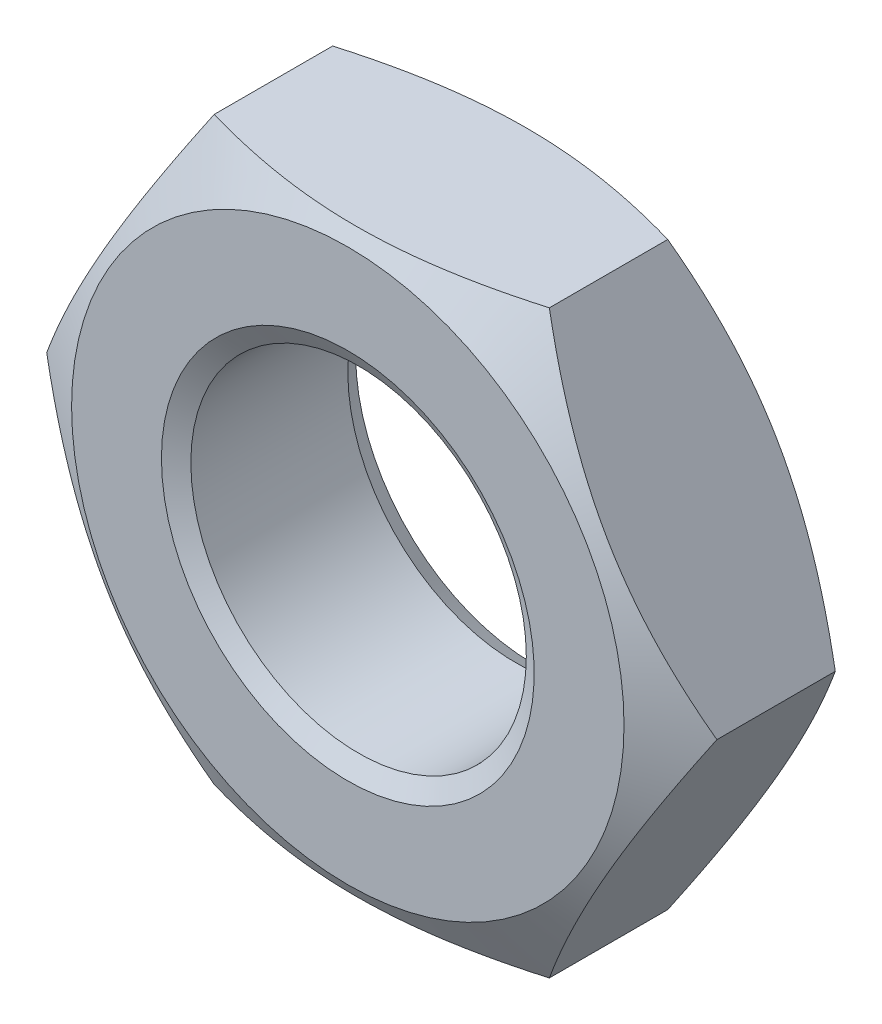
ISO-10303-21;
HEADER;
FILE_DESCRIPTION(('STEP AP214'),'2;1');
FILE_NAME('part.step','',(''),(''),'','','');
FILE_SCHEMA(('AUTOMOTIVE_DESIGN { 1 0 10303 214 1 1 1 1 }'));
ENDSEC;
DATA;
#1=APPLICATION_CONTEXT('core data for automotive mechanical design processes');
#2=APPLICATION_PROTOCOL_DEFINITION('international standard','automotive_design',2000,#1);
#3=PRODUCT_CONTEXT('',#1,'mechanical');
#4=PRODUCT('Part','Part','',(#3));
#5=PRODUCT_RELATED_PRODUCT_CATEGORY('part','',(#4));
#6=PRODUCT_DEFINITION_FORMATION('','',#4);
#7=PRODUCT_DEFINITION_CONTEXT('part definition',#1,'design');
#8=PRODUCT_DEFINITION('design','',#6,#7);
#9=PRODUCT_DEFINITION_SHAPE('','',#8);
#10=(LENGTH_UNIT() NAMED_UNIT(*) SI_UNIT(.MILLI.,.METRE.));
#11=(NAMED_UNIT(*) PLANE_ANGLE_UNIT() SI_UNIT($,.RADIAN.));
#12=(NAMED_UNIT(*) SI_UNIT($,.STERADIAN.) SOLID_ANGLE_UNIT());
#13=UNCERTAINTY_MEASURE_WITH_UNIT(LENGTH_MEASURE(1.E-05),#10,'distance_accuracy_value','');
#14=(GEOMETRIC_REPRESENTATION_CONTEXT(3) GLOBAL_UNCERTAINTY_ASSIGNED_CONTEXT((#13)) GLOBAL_UNIT_ASSIGNED_CONTEXT((#10,
#11,#12)) REPRESENTATION_CONTEXT('',''));
#15=CARTESIAN_POINT('',(0.,0.,0.));
#16=DIRECTION('',(0.,0.,1.));
#17=DIRECTION('',(1.,0.,0.));
#18=AXIS2_PLACEMENT_3D('',#15,#16,#17);
#19=CARTESIAN_POINT('',(-4.49467184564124,-7.785,-5.));
#20=DIRECTION('',(0.,-1.,0.));
#21=DIRECTION('',(0.,0.,-1.));
#22=AXIS2_PLACEMENT_3D('',#19,#20,#21);
#23=PLANE('',#22);
#24=CARTESIAN_POINT('',(-11.8905285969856,-7.785,-3.92733866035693));
#25=CARTESIAN_POINT('',(-11.5489555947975,-7.785,-3.76239656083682));
#26=CARTESIAN_POINT('',(-11.2065716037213,-7.785,-3.59910334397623));
#27=CARTESIAN_POINT('',(-10.5197429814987,-7.785,-3.27675761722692));
#28=CARTESIAN_POINT('',(-10.1752980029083,-7.785,-3.11770584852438));
#29=CARTESIAN_POINT('',(-9.48203318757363,-7.785,-2.80394149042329));
#30=CARTESIAN_POINT('',(-9.13319957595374,-7.785,-2.64925922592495));
#31=CARTESIAN_POINT('',(-8.43265418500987,-7.785,-2.34658203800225));
#32=CARTESIAN_POINT('',(-8.08094255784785,-7.785,-2.19858676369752));
#33=CARTESIAN_POINT('',(-7.36985523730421,-7.785,-1.90936329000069));
#34=CARTESIAN_POINT('',(-7.01043813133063,-7.785,-1.76823633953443));
#35=CARTESIAN_POINT('',(-6.28735489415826,-7.785,-1.49711048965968));
#36=CARTESIAN_POINT('',(-5.92368829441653,-7.785,-1.36711283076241));
#37=CARTESIAN_POINT('',(-5.19228001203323,-7.785,-1.12176103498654));
#38=CARTESIAN_POINT('',(-4.82454897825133,-7.785,-1.0063755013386));
#39=CARTESIAN_POINT('',(-4.08387380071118,-7.785,-0.794012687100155));
#40=CARTESIAN_POINT('',(-3.71093135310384,-7.785,-0.697029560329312));
#41=CARTESIAN_POINT('',(-2.95950424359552,-7.785,-0.526203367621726));
#42=CARTESIAN_POINT('',(-2.5810177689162,-7.785,-0.452368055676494));
#43=CARTESIAN_POINT('',(-2.00998351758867,-7.785,-0.362690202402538));
#44=CARTESIAN_POINT('',(-1.81906463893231,-7.785,-0.336308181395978));
#45=CARTESIAN_POINT('',(-1.43634152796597,-7.785,-0.291088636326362));
#46=CARTESIAN_POINT('',(-1.24453738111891,-7.785,-0.272250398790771));
#47=CARTESIAN_POINT('',(-0.861503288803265,-7.785,-0.242624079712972));
#48=CARTESIAN_POINT('',(-0.670277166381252,-7.785,-0.231786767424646));
#49=CARTESIAN_POINT('',(-0.287538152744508,-7.785,-0.218219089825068));
#50=CARTESIAN_POINT('',(-0.0960252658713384,-7.785,-0.215488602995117));
#51=CARTESIAN_POINT('',(0.286890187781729,-7.785,-0.218199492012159));
#52=CARTESIAN_POINT('',(0.478292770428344,-7.785,-0.223638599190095));
#53=CARTESIAN_POINT('',(0.860703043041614,-7.785,-0.242554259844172));
#54=CARTESIAN_POINT('',(1.0517107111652,-7.785,-0.256031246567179));
#55=CARTESIAN_POINT('',(1.51548079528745,-7.785,-0.298232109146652));
#56=CARTESIAN_POINT('',(1.78787972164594,-7.785,-0.331029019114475));
#57=CARTESIAN_POINT('',(2.33052339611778,-7.785,-0.411137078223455));
#58=CARTESIAN_POINT('',(2.60076781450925,-7.785,-0.458450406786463));
#59=CARTESIAN_POINT('',(3.40875074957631,-7.785,-0.619789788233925));
#60=CARTESIAN_POINT('',(3.94268076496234,-7.785,-0.753106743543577));
#61=CARTESIAN_POINT('',(4.74129195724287,-7.785,-0.982731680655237));
#62=CARTESIAN_POINT('',(5.01015205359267,-7.785,-1.06532838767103));
#63=CARTESIAN_POINT('',(5.5452749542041,-7.785,-1.23869573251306));
#64=CARTESIAN_POINT('',(5.81153752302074,-7.785,-1.32946710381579));
#65=CARTESIAN_POINT('',(6.34013584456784,-7.785,-1.51724339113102));
#66=CARTESIAN_POINT('',(6.60248528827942,-7.785,-1.61421015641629));
#67=CARTESIAN_POINT('',(7.12495570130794,-7.785,-1.81371986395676));
#68=CARTESIAN_POINT('',(7.38507740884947,-7.785,-1.91626086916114));
#69=CARTESIAN_POINT('',(7.64426180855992,-7.785,-2.02106629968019));
#70=B_SPLINE_CURVE_WITH_KNOTS('',3,(#24,#25,#26,#27,#28,#29,#30,#31,#32,#33,#34,#35,#36,#37,#38,
#39,#40,#41,#42,#43,#44,#45,#46,#47,#48,#49,#50,#51,#52,#53,#54,#55,#56,#57,#58,#59,#60,#61,#62,
#63,#64,#65,#66,#67,#68,#69),.UNSPECIFIED.,.F.,.F.,(4,2,2,2,2,2,2,2,2,2,2,2,2,2,2,2,2,2,2,2,2,2,
4),(0.,1.13795308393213,2.27610373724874,3.42082014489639,4.56547641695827,5.72372773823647,
6.88210799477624,8.03795543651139,9.19343506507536,10.3493013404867,10.9273748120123,
11.5053935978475,12.0798254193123,12.654248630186,13.2285123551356,13.8028070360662,
14.6254376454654,15.4481918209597,17.096877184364,17.9405966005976,18.7843917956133,
19.623415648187,20.4621497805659),.UNSPECIFIED.);
#71=CARTESIAN_POINT('',(-4.49467184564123,-7.785,-0.911834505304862));
#72=VERTEX_POINT('',#71);
#73=CARTESIAN_POINT('',(4.49467184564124,-7.785,-0.911834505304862));
#74=VERTEX_POINT('',#73);
#75=EDGE_CURVE('E50',#72,#74,#70,.T.);
#76=ORIENTED_EDGE('',*,*,#75,.F.);
#77=DIRECTION('',(0.,0.,1.));
#78=VECTOR('',#77,1.);
#79=CARTESIAN_POINT('',(-4.49467184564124,-7.785,-5.));
#80=LINE('',#79,#78);
#81=CARTESIAN_POINT('',(-4.49467184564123,-7.78500000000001,-4.08816549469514));
#82=VERTEX_POINT('',#81);
#83=EDGE_CURVE('E105',#82,#72,#80,.T.);
#84=ORIENTED_EDGE('',*,*,#83,.F.);
#85=CARTESIAN_POINT('',(-11.8905285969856,-7.785,-1.07266133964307));
#86=CARTESIAN_POINT('',(-11.5489555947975,-7.785,-1.23760343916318));
#87=CARTESIAN_POINT('',(-11.2065716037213,-7.785,-1.40089665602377));
#88=CARTESIAN_POINT('',(-10.5197429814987,-7.785,-1.72324238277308));
#89=CARTESIAN_POINT('',(-10.1752980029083,-7.785,-1.88229415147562));
#90=CARTESIAN_POINT('',(-9.48203318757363,-7.785,-2.19605850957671));
#91=CARTESIAN_POINT('',(-9.13319957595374,-7.785,-2.35074077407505));
#92=CARTESIAN_POINT('',(-8.43265418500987,-7.785,-2.65341796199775));
#93=CARTESIAN_POINT('',(-8.08094255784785,-7.785,-2.80141323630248));
#94=CARTESIAN_POINT('',(-7.36985523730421,-7.785,-3.09063670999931));
#95=CARTESIAN_POINT('',(-7.01043813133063,-7.785,-3.23176366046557));
#96=CARTESIAN_POINT('',(-6.28735489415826,-7.785,-3.50288951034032));
#97=CARTESIAN_POINT('',(-5.92368829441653,-7.785,-3.63288716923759));
#98=CARTESIAN_POINT('',(-5.19228001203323,-7.785,-3.87823896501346));
#99=CARTESIAN_POINT('',(-4.82454897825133,-7.785,-3.9936244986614));
#100=CARTESIAN_POINT('',(-4.08387380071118,-7.785,-4.20598731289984));
#101=CARTESIAN_POINT('',(-3.71093135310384,-7.785,-4.30297043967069));
#102=CARTESIAN_POINT('',(-2.95950424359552,-7.785,-4.47379663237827));
#103=CARTESIAN_POINT('',(-2.5810177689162,-7.785,-4.54763194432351));
#104=CARTESIAN_POINT('',(-2.00998351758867,-7.785,-4.63730979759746));
#105=CARTESIAN_POINT('',(-1.81906463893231,-7.785,-4.66369181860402));
#106=CARTESIAN_POINT('',(-1.43634152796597,-7.785,-4.70891136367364));
#107=CARTESIAN_POINT('',(-1.24453738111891,-7.785,-4.72774960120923));
#108=CARTESIAN_POINT('',(-0.861503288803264,-7.785,-4.75737592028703));
#109=CARTESIAN_POINT('',(-0.670277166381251,-7.785,-4.76821323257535));
#110=CARTESIAN_POINT('',(-0.287538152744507,-7.785,-4.78178091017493));
#111=CARTESIAN_POINT('',(-0.096025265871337,-7.785,-4.78451139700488));
#112=CARTESIAN_POINT('',(0.286890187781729,-7.785,-4.78180050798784));
#113=CARTESIAN_POINT('',(0.478292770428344,-7.785,-4.7763614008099));
#114=CARTESIAN_POINT('',(0.860703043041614,-7.785,-4.75744574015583));
#115=CARTESIAN_POINT('',(1.0517107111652,-7.785,-4.74396875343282));
#116=CARTESIAN_POINT('',(1.51548079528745,-7.785,-4.70176789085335));
#117=CARTESIAN_POINT('',(1.78787972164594,-7.785,-4.66897098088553));
#118=CARTESIAN_POINT('',(2.33052339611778,-7.785,-4.58886292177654));
#119=CARTESIAN_POINT('',(2.60076781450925,-7.785,-4.54154959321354));
#120=CARTESIAN_POINT('',(3.40875074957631,-7.785,-4.38021021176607));
#121=CARTESIAN_POINT('',(3.94268076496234,-7.785,-4.24689325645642));
#122=CARTESIAN_POINT('',(4.74129195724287,-7.785,-4.01726831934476));
#123=CARTESIAN_POINT('',(5.01015205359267,-7.785,-3.93467161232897));
#124=CARTESIAN_POINT('',(5.5452749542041,-7.785,-3.76130426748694));
#125=CARTESIAN_POINT('',(5.81153752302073,-7.785,-3.67053289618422));
#126=CARTESIAN_POINT('',(6.34013584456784,-7.785,-3.48275660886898));
#127=CARTESIAN_POINT('',(6.60248528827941,-7.785,-3.38578984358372));
#128=CARTESIAN_POINT('',(7.12495570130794,-7.785,-3.18628013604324));
#129=CARTESIAN_POINT('',(7.38507740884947,-7.785,-3.08373913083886));
#130=CARTESIAN_POINT('',(7.64426180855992,-7.785,-2.97893370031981));
#131=B_SPLINE_CURVE_WITH_KNOTS('',3,(#85,#86,#87,#88,#89,#90,#91,#92,#93,#94,#95,#96,#97,#98,
#99,#100,#101,#102,#103,#104,#105,#106,#107,#108,#109,#110,#111,#112,#113,#114,#115,#116,#117,
#118,#119,#120,#121,#122,#123,#124,#125,#126,#127,#128,#129,#130),.UNSPECIFIED.,.F.,.F.,(4,2,2,
2,2,2,2,2,2,2,2,2,2,2,2,2,2,2,2,2,2,2,4),(0.,1.13795308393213,2.27610373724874,3.42082014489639,
4.56547641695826,5.72372773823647,6.88210799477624,8.03795543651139,9.19343506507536,
10.3493013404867,10.9273748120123,11.5053935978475,12.0798254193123,12.654248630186,
13.2285123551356,13.8028070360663,14.6254376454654,15.4481918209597,17.096877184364,
17.9405966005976,18.7843917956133,19.623415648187,20.4621497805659),.UNSPECIFIED.);
#132=CARTESIAN_POINT('',(4.49467184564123,-7.785,-4.08816549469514));
#133=VERTEX_POINT('',#132);
#134=EDGE_CURVE('E126',#133,#82,#131,.F.);
#135=ORIENTED_EDGE('',*,*,#134,.F.);
#136=DIRECTION('',(0.,0.,1.));
#137=VECTOR('',#136,1.);
#138=CARTESIAN_POINT('',(4.49467184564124,-7.785,-5.));
#139=LINE('',#138,#137);
#140=EDGE_CURVE('E123',#133,#74,#139,.T.);
#141=ORIENTED_EDGE('',*,*,#140,.T.);
#142=EDGE_LOOP('',(#76,#84,#135,#141));
#143=FACE_BOUND('',#142,.T.);
#144=ADVANCED_FACE('F35',(#143),#23,.T.);
#145=CARTESIAN_POINT('',(-8.98934369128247,0.,-5.));
#146=DIRECTION('',(-0.866025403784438,-0.5,0.));
#147=DIRECTION('',(0.5,-0.866025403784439,0.));
#148=AXIS2_PLACEMENT_3D('',#145,#146,#147);
#149=PLANE('',#148);
#150=CARTESIAN_POINT('',(-8.98945916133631,0.000200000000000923,-0.911901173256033));
#151=CARTESIAN_POINT('',(-8.89066130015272,-0.170922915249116,-0.854869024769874));
#152=CARTESIAN_POINT('',(-8.79149508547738,-0.342683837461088,-0.800425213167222));
#153=CARTESIAN_POINT('',(-8.59235732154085,-0.687600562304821,-0.697427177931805));
#154=CARTESIAN_POINT('',(-8.49238544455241,-0.860756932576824,-0.648875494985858));
#155=CARTESIAN_POINT('',(-8.19086911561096,-1.38299853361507,-0.51301169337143));
#156=CARTESIAN_POINT('',(-7.98813444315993,-1.73414528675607,-0.435734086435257));
#157=CARTESIAN_POINT('',(-7.68474592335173,-2.25962961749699,-0.345116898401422));
#158=CARTESIAN_POINT('',(-7.58499844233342,-2.43239732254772,-0.319302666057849));
#159=CARTESIAN_POINT('',(-7.38505239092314,-2.77871404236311,-0.27601653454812));
#160=CARTESIAN_POINT('',(-7.28485386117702,-2.95226298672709,-0.25854389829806));
#161=CARTESIAN_POINT('',(-7.08428427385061,-3.29965970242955,-0.232383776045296));
#162=CARTESIAN_POINT('',(-6.9839135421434,-3.4735069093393,-0.22368632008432));
#163=CARTESIAN_POINT('',(-6.78307935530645,-3.82136192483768,-0.21526302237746));
#164=CARTESIAN_POINT('',(-6.6826159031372,-3.99536972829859,-0.215536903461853));
#165=CARTESIAN_POINT('',(-6.49479564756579,-4.32068395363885,-0.2244323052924));
#166=CARTESIAN_POINT('',(-6.40742559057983,-4.47201333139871,-0.231968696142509));
#167=CARTESIAN_POINT('',(-6.23288979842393,-4.77431819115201,-0.253680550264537));
#168=CARTESIAN_POINT('',(-6.1457240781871,-4.92529364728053,-0.267856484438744));
#169=CARTESIAN_POINT('',(-5.88456467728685,-5.37763499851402,-0.320008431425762));
#170=CARTESIAN_POINT('',(-5.71103327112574,-5.67820021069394,-0.367602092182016));
#171=CARTESIAN_POINT('',(-5.36212965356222,-6.28251900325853,-0.486587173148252));
#172=CARTESIAN_POINT('',(-5.18680197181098,-6.58619545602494,-0.558482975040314));
#173=CARTESIAN_POINT('',(-4.83876122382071,-7.18901971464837,-0.721656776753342));
#174=CARTESIAN_POINT('',(-4.66604370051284,-7.48817524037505,-0.812896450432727));
#175=CARTESIAN_POINT('',(-4.4945563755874,-7.7852,-0.911901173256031));
#176=B_SPLINE_CURVE_WITH_KNOTS('',3,(#150,#151,#152,#153,#154,#155,#156,#157,#158,#159,#160,
#161,#162,#163,#164,#165,#166,#167,#168,#169,#170,#171,#172,#173,#174,#175),.UNSPECIFIED.,.F.,
.F.,(4,2,2,2,2,2,2,2,2,2,2,2,4),(0.,0.616935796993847,1.23413667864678,2.47110303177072,
3.07443713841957,3.67771792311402,4.28031251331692,4.88288848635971,5.40746540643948,
5.93207953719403,6.98205325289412,8.05531350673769,9.1264668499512),.UNSPECIFIED.);
#177=CARTESIAN_POINT('',(-8.98934369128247,0.,-0.911834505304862));
#178=VERTEX_POINT('',#177);
#179=EDGE_CURVE('E90',#178,#72,#176,.T.);
#180=ORIENTED_EDGE('',*,*,#179,.F.);
#181=DIRECTION('',(0.,0.,1.));
#182=VECTOR('',#181,1.);
#183=CARTESIAN_POINT('',(-8.98934369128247,0.,-5.));
#184=LINE('',#183,#182);
#185=CARTESIAN_POINT('',(-8.98934369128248,0.,-4.08816549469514));
#186=VERTEX_POINT('',#185);
#187=EDGE_CURVE('E103',#186,#178,#184,.T.);
#188=ORIENTED_EDGE('',*,*,#187,.F.);
#189=CARTESIAN_POINT('',(-4.4945563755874,-7.7852,-4.08809882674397));
#190=CARTESIAN_POINT('',(-4.59335423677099,-7.61407708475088,-4.14513097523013));
#191=CARTESIAN_POINT('',(-4.69252045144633,-7.44231616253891,-4.19957478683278));
#192=CARTESIAN_POINT('',(-4.89165821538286,-7.09739943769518,-4.3025728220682));
#193=CARTESIAN_POINT('',(-4.9916300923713,-6.92424306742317,-4.35112450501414));
#194=CARTESIAN_POINT('',(-5.29314642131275,-6.40200146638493,-4.48698830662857));
#195=CARTESIAN_POINT('',(-5.49588109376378,-6.05085471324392,-4.56426591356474));
#196=CARTESIAN_POINT('',(-5.79926961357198,-5.52537038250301,-4.65488310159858));
#197=CARTESIAN_POINT('',(-5.89901709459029,-5.35260267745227,-4.68069733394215));
#198=CARTESIAN_POINT('',(-6.09896314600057,-5.00628595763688,-4.72398346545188));
#199=CARTESIAN_POINT('',(-6.19916167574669,-4.83273701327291,-4.74145610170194));
#200=CARTESIAN_POINT('',(-6.3997312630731,-4.48534029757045,-4.7676162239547));
#201=CARTESIAN_POINT('',(-6.50010199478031,-4.3114930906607,-4.77631367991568));
#202=CARTESIAN_POINT('',(-6.70093618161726,-3.96363807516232,-4.78473697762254));
#203=CARTESIAN_POINT('',(-6.80139963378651,-3.78963027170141,-4.78446309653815));
#204=CARTESIAN_POINT('',(-6.98921988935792,-3.46431604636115,-4.7755676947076));
#205=CARTESIAN_POINT('',(-7.07658994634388,-3.31298666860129,-4.76803130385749));
#206=CARTESIAN_POINT('',(-7.25112573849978,-3.01068180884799,-4.74631944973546));
#207=CARTESIAN_POINT('',(-7.33829145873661,-2.85970635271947,-4.73214351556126));
#208=CARTESIAN_POINT('',(-7.59945085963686,-2.40736500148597,-4.67999156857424));
#209=CARTESIAN_POINT('',(-7.77298226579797,-2.10679978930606,-4.63239790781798));
#210=CARTESIAN_POINT('',(-8.12188588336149,-1.50248099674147,-4.51341282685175));
#211=CARTESIAN_POINT('',(-8.29721356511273,-1.19880454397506,-4.44151702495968));
#212=CARTESIAN_POINT('',(-8.645254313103,-0.595980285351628,-4.27834322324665));
#213=CARTESIAN_POINT('',(-8.81797183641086,-0.296824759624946,-4.18710354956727));
#214=CARTESIAN_POINT('',(-8.98945916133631,0.000200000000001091,-4.08809882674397));
#215=B_SPLINE_CURVE_WITH_KNOTS('',3,(#189,#190,#191,#192,#193,#194,#195,#196,#197,#198,#199,
#200,#201,#202,#203,#204,#205,#206,#207,#208,#209,#210,#211,#212,#213,#214),.UNSPECIFIED.,.F.,
.F.,(4,2,2,2,2,2,2,2,2,2,2,2,4),(0.,0.616935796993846,1.23413667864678,2.47110303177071,
3.07443713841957,3.67771792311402,4.28031251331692,4.88288848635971,5.40746540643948,
5.93207953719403,6.98205325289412,8.0553135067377,9.1264668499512),.UNSPECIFIED.);
#216=EDGE_CURVE('E194',#82,#186,#215,.T.);
#217=ORIENTED_EDGE('',*,*,#216,.F.);
#218=ORIENTED_EDGE('',*,*,#83,.T.);
#219=EDGE_LOOP('',(#180,#188,#217,#218));
#220=FACE_BOUND('',#219,.T.);
#221=ADVANCED_FACE('F101',(#220),#149,.T.);
#222=CARTESIAN_POINT('',(-4.49467184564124,7.785,-5.));
#223=DIRECTION('',(-0.866025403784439,0.5,0.));
#224=DIRECTION('',(-0.5,-0.866025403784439,0.));
#225=AXIS2_PLACEMENT_3D('',#222,#223,#224);
#226=PLANE('',#225);
#227=CARTESIAN_POINT('',(-4.4945563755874,7.7852,-0.911901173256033));
#228=CARTESIAN_POINT('',(-4.59335423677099,7.61407708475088,-0.854869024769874));
#229=CARTESIAN_POINT('',(-4.69252045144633,7.44231616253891,-0.800425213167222));
#230=CARTESIAN_POINT('',(-4.89165821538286,7.09739943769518,-0.697427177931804));
#231=CARTESIAN_POINT('',(-4.9916300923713,6.92424306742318,-0.648875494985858));
#232=CARTESIAN_POINT('',(-5.29314642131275,6.40200146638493,-0.51301169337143));
#233=CARTESIAN_POINT('',(-5.49588109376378,6.05085471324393,-0.435734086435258));
#234=CARTESIAN_POINT('',(-5.79926961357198,5.52537038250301,-0.345116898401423));
#235=CARTESIAN_POINT('',(-5.89901709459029,5.35260267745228,-0.31930266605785));
#236=CARTESIAN_POINT('',(-6.09896314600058,5.00628595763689,-0.276016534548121));
#237=CARTESIAN_POINT('',(-6.19916167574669,4.83273701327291,-0.258543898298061));
#238=CARTESIAN_POINT('',(-6.3997312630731,4.48534029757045,-0.232383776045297));
#239=CARTESIAN_POINT('',(-6.50010199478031,4.3114930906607,-0.223686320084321));
#240=CARTESIAN_POINT('',(-6.70093618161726,3.96363807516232,-0.215263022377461));
#241=CARTESIAN_POINT('',(-6.80139963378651,3.78963027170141,-0.215536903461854));
#242=CARTESIAN_POINT('',(-6.98921988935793,3.46431604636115,-0.224432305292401));
#243=CARTESIAN_POINT('',(-7.07658994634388,3.31298666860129,-0.23196869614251));
#244=CARTESIAN_POINT('',(-7.25112573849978,3.01068180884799,-0.253680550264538));
#245=CARTESIAN_POINT('',(-7.33829145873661,2.85970635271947,-0.267856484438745));
#246=CARTESIAN_POINT('',(-7.59945085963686,2.40736500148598,-0.320008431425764));
#247=CARTESIAN_POINT('',(-7.77298226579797,2.10679978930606,-0.367602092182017));
#248=CARTESIAN_POINT('',(-8.12188588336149,1.50248099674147,-0.486587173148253));
#249=CARTESIAN_POINT('',(-8.29721356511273,1.19880454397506,-0.558482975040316));
#250=CARTESIAN_POINT('',(-8.645254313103,0.595980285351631,-0.721656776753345));
#251=CARTESIAN_POINT('',(-8.81797183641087,0.296824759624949,-0.81289645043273));
#252=CARTESIAN_POINT('',(-8.98945916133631,-0.000199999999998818,-0.911901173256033));
#253=B_SPLINE_CURVE_WITH_KNOTS('',3,(#227,#228,#229,#230,#231,#232,#233,#234,#235,#236,#237,
#238,#239,#240,#241,#242,#243,#244,#245,#246,#247,#248,#249,#250,#251,#252),.UNSPECIFIED.,.F.,
.F.,(4,2,2,2,2,2,2,2,2,2,2,2,4),(0.,0.616935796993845,1.23413667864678,2.47110303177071,
3.07443713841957,3.67771792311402,4.28031251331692,4.88288848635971,5.40746540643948,
5.93207953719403,6.98205325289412,8.05531350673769,9.1264668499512),.UNSPECIFIED.);
#254=CARTESIAN_POINT('',(-4.49467184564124,7.785,-0.911834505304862));
#255=VERTEX_POINT('',#254);
#256=EDGE_CURVE('E86',#255,#178,#253,.T.);
#257=ORIENTED_EDGE('',*,*,#256,.F.);
#258=DIRECTION('',(0.,0.,1.));
#259=VECTOR('',#258,1.);
#260=CARTESIAN_POINT('',(-4.49467184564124,7.785,-5.));
#261=LINE('',#260,#259);
#262=CARTESIAN_POINT('',(-4.49467184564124,7.785,-4.08816549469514));
#263=VERTEX_POINT('',#262);
#264=EDGE_CURVE('E110',#263,#255,#261,.T.);
#265=ORIENTED_EDGE('',*,*,#264,.F.);
#266=CARTESIAN_POINT('',(-8.98945916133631,-0.000199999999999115,-4.08809882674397));
#267=CARTESIAN_POINT('',(-8.89066130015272,0.170922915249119,-4.14513097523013));
#268=CARTESIAN_POINT('',(-8.79149508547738,0.34268383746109,-4.19957478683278));
#269=CARTESIAN_POINT('',(-8.59235732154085,0.687600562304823,-4.3025728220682));
#270=CARTESIAN_POINT('',(-8.49238544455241,0.860756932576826,-4.35112450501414));
#271=CARTESIAN_POINT('',(-8.19086911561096,1.38299853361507,-4.48698830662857));
#272=CARTESIAN_POINT('',(-7.98813444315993,1.73414528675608,-4.56426591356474));
#273=CARTESIAN_POINT('',(-7.68474592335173,2.25962961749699,-4.65488310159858));
#274=CARTESIAN_POINT('',(-7.58499844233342,2.43239732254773,-4.68069733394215));
#275=CARTESIAN_POINT('',(-7.38505239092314,2.77871404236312,-4.72398346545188));
#276=CARTESIAN_POINT('',(-7.28485386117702,2.95226298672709,-4.74145610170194));
#277=CARTESIAN_POINT('',(-7.08428427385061,3.29965970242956,-4.7676162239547));
#278=CARTESIAN_POINT('',(-6.98391354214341,3.4735069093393,-4.77631367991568));
#279=CARTESIAN_POINT('',(-6.78307935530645,3.82136192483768,-4.78473697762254));
#280=CARTESIAN_POINT('',(-6.6826159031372,3.99536972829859,-4.78446309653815));
#281=CARTESIAN_POINT('',(-6.49479564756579,4.32068395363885,-4.7755676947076));
#282=CARTESIAN_POINT('',(-6.40742559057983,4.47201333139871,-4.76803130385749));
#283=CARTESIAN_POINT('',(-6.23288979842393,4.77431819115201,-4.74631944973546));
#284=CARTESIAN_POINT('',(-6.14572407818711,4.92529364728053,-4.73214351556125));
#285=CARTESIAN_POINT('',(-5.88456467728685,5.37763499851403,-4.67999156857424));
#286=CARTESIAN_POINT('',(-5.71103327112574,5.67820021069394,-4.63239790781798));
#287=CARTESIAN_POINT('',(-5.36212965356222,6.28251900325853,-4.51341282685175));
#288=CARTESIAN_POINT('',(-5.18680197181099,6.58619545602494,-4.44151702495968));
#289=CARTESIAN_POINT('',(-4.83876122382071,7.18901971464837,-4.27834322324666));
#290=CARTESIAN_POINT('',(-4.66604370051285,7.48817524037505,-4.18710354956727));
#291=CARTESIAN_POINT('',(-4.4945563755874,7.7852,-4.08809882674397));
#292=B_SPLINE_CURVE_WITH_KNOTS('',3,(#266,#267,#268,#269,#270,#271,#272,#273,#274,#275,#276,
#277,#278,#279,#280,#281,#282,#283,#284,#285,#286,#287,#288,#289,#290,#291),.UNSPECIFIED.,.F.,
.F.,(4,2,2,2,2,2,2,2,2,2,2,2,4),(0.,0.616935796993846,1.23413667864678,2.47110303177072,
3.07443713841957,3.67771792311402,4.28031251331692,4.88288848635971,5.40746540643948,
5.93207953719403,6.98205325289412,8.05531350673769,9.1264668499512),.UNSPECIFIED.);
#293=EDGE_CURVE('E109',#186,#263,#292,.T.);
#294=ORIENTED_EDGE('',*,*,#293,.F.);
#295=ORIENTED_EDGE('',*,*,#187,.T.);
#296=EDGE_LOOP('',(#257,#265,#294,#295));
#297=FACE_BOUND('',#296,.T.);
#298=ADVANCED_FACE('F108',(#297),#226,.T.);
#299=CARTESIAN_POINT('',(4.49467184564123,7.785,-5.));
#300=DIRECTION('',(0.,1.,0.));
#301=DIRECTION('',(0.,0.,1.));
#302=AXIS2_PLACEMENT_3D('',#299,#300,#301);
#303=PLANE('',#302);
#304=CARTESIAN_POINT('',(-11.8905285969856,7.785,-3.92733866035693));
#305=CARTESIAN_POINT('',(-11.5489555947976,7.785,-3.76239656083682));
#306=CARTESIAN_POINT('',(-11.2065716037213,7.785,-3.59910334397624));
#307=CARTESIAN_POINT('',(-10.5197429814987,7.785,-3.27675761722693));
#308=CARTESIAN_POINT('',(-10.1752980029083,7.785,-3.11770584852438));
#309=CARTESIAN_POINT('',(-9.48203318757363,7.785,-2.80394149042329));
#310=CARTESIAN_POINT('',(-9.13319957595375,7.785,-2.64925922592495));
#311=CARTESIAN_POINT('',(-8.43265418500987,7.785,-2.34658203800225));
#312=CARTESIAN_POINT('',(-8.08094255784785,7.785,-2.19858676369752));
#313=CARTESIAN_POINT('',(-7.36985523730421,7.785,-1.90936329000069));
#314=CARTESIAN_POINT('',(-7.01043813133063,7.785,-1.76823633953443));
#315=CARTESIAN_POINT('',(-6.28735489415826,7.785,-1.49711048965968));
#316=CARTESIAN_POINT('',(-5.92368829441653,7.785,-1.36711283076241));
#317=CARTESIAN_POINT('',(-5.19228001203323,7.785,-1.12176103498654));
#318=CARTESIAN_POINT('',(-4.82454897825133,7.785,-1.0063755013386));
#319=CARTESIAN_POINT('',(-4.08387380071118,7.785,-0.794012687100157));
#320=CARTESIAN_POINT('',(-3.71093135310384,7.785,-0.697029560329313));
#321=CARTESIAN_POINT('',(-2.95950424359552,7.785,-0.526203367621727));
#322=CARTESIAN_POINT('',(-2.5810177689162,7.785,-0.452368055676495));
#323=CARTESIAN_POINT('',(-2.00998351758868,7.785,-0.36269020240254));
#324=CARTESIAN_POINT('',(-1.81906463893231,7.785,-0.33630818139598));
#325=CARTESIAN_POINT('',(-1.43634152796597,7.785,-0.291088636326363));
#326=CARTESIAN_POINT('',(-1.24453738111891,7.785,-0.272250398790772));
#327=CARTESIAN_POINT('',(-0.861503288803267,7.785,-0.242624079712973));
#328=CARTESIAN_POINT('',(-0.670277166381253,7.785,-0.231786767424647));
#329=CARTESIAN_POINT('',(-0.287538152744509,7.785,-0.218219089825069));
#330=CARTESIAN_POINT('',(-0.0960252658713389,7.785,-0.215488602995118));
#331=CARTESIAN_POINT('',(0.286890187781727,7.785,-0.21819949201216));
#332=CARTESIAN_POINT('',(0.478292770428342,7.785,-0.223638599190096));
#333=CARTESIAN_POINT('',(0.860703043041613,7.785,-0.242554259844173));
#334=CARTESIAN_POINT('',(1.0517107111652,7.785,-0.25603124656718));
#335=CARTESIAN_POINT('',(1.51548079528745,7.785,-0.298232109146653));
#336=CARTESIAN_POINT('',(1.78787972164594,7.785,-0.331029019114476));
#337=CARTESIAN_POINT('',(2.33052339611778,7.785,-0.411137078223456));
#338=CARTESIAN_POINT('',(2.60076781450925,7.785,-0.458450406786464));
#339=CARTESIAN_POINT('',(3.40875074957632,7.785,-0.619789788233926));
#340=CARTESIAN_POINT('',(3.94268076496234,7.785,-0.753106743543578));
#341=CARTESIAN_POINT('',(4.74129195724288,7.785,-0.982731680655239));
#342=CARTESIAN_POINT('',(5.01015205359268,7.785,-1.06532838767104));
#343=CARTESIAN_POINT('',(5.54527495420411,7.785,-1.23869573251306));
#344=CARTESIAN_POINT('',(5.81153752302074,7.785,-1.32946710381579));
#345=CARTESIAN_POINT('',(6.34013584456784,7.785,-1.51724339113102));
#346=CARTESIAN_POINT('',(6.60248528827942,7.785,-1.61421015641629));
#347=CARTESIAN_POINT('',(7.12495570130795,7.785,-1.81371986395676));
#348=CARTESIAN_POINT('',(7.38507740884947,7.785,-1.91626086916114));
#349=CARTESIAN_POINT('',(7.64426180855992,7.785,-2.0210662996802));
#350=B_SPLINE_CURVE_WITH_KNOTS('',3,(#304,#305,#306,#307,#308,#309,#310,#311,#312,#313,#314,
#315,#316,#317,#318,#319,#320,#321,#322,#323,#324,#325,#326,#327,#328,#329,#330,#331,#332,#333,
#334,#335,#336,#337,#338,#339,#340,#341,#342,#343,#344,#345,#346,#347,#348,#349),.UNSPECIFIED.,
.F.,.F.,(4,2,2,2,2,2,2,2,2,2,2,2,2,2,2,2,2,2,2,2,2,2,4),(0.,1.13795308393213,2.27610373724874,
3.42082014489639,4.56547641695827,5.72372773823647,6.88210799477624,8.03795543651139,
9.19343506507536,10.3493013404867,10.9273748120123,11.5053935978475,12.0798254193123,
12.654248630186,13.2285123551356,13.8028070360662,14.6254376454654,15.4481918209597,
17.096877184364,17.9405966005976,18.7843917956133,19.623415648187,20.4621497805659),.UNSPECIFIED.);
#351=CARTESIAN_POINT('',(4.49467184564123,7.78500000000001,-0.911834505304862));
#352=VERTEX_POINT('',#351);
#353=EDGE_CURVE('E92',#352,#255,#350,.F.);
#354=ORIENTED_EDGE('',*,*,#353,.F.);
#355=DIRECTION('',(0.,0.,1.));
#356=VECTOR('',#355,1.);
#357=CARTESIAN_POINT('',(4.49467184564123,7.785,-5.));
#358=LINE('',#357,#356);
#359=CARTESIAN_POINT('',(4.49467184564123,7.78500000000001,-4.08816549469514));
#360=VERTEX_POINT('',#359);
#361=EDGE_CURVE('E114',#360,#352,#358,.T.);
#362=ORIENTED_EDGE('',*,*,#361,.F.);
#363=CARTESIAN_POINT('',(-11.8905285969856,7.785,-1.07266133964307));
#364=CARTESIAN_POINT('',(-11.5489555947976,7.785,-1.23760343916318));
#365=CARTESIAN_POINT('',(-11.2065716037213,7.785,-1.40089665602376));
#366=CARTESIAN_POINT('',(-10.5197429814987,7.785,-1.72324238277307));
#367=CARTESIAN_POINT('',(-10.1752980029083,7.785,-1.88229415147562));
#368=CARTESIAN_POINT('',(-9.48203318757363,7.785,-2.19605850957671));
#369=CARTESIAN_POINT('',(-9.13319957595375,7.785,-2.35074077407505));
#370=CARTESIAN_POINT('',(-8.43265418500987,7.785,-2.65341796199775));
#371=CARTESIAN_POINT('',(-8.08094255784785,7.785,-2.80141323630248));
#372=CARTESIAN_POINT('',(-7.36985523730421,7.785,-3.09063670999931));
#373=CARTESIAN_POINT('',(-7.01043813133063,7.785,-3.23176366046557));
#374=CARTESIAN_POINT('',(-6.28735489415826,7.785,-3.50288951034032));
#375=CARTESIAN_POINT('',(-5.92368829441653,7.785,-3.63288716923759));
#376=CARTESIAN_POINT('',(-5.19228001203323,7.785,-3.87823896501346));
#377=CARTESIAN_POINT('',(-4.82454897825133,7.785,-3.9936244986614));
#378=CARTESIAN_POINT('',(-4.08387380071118,7.785,-4.20598731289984));
#379=CARTESIAN_POINT('',(-3.71093135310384,7.785,-4.30297043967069));
#380=CARTESIAN_POINT('',(-2.95950424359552,7.785,-4.47379663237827));
#381=CARTESIAN_POINT('',(-2.5810177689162,7.785,-4.5476319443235));
#382=CARTESIAN_POINT('',(-2.00998351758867,7.785,-4.63730979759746));
#383=CARTESIAN_POINT('',(-1.81906463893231,7.785,-4.66369181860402));
#384=CARTESIAN_POINT('',(-1.43634152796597,7.785,-4.70891136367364));
#385=CARTESIAN_POINT('',(-1.24453738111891,7.785,-4.72774960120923));
#386=CARTESIAN_POINT('',(-0.861503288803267,7.785,-4.75737592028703));
#387=CARTESIAN_POINT('',(-0.670277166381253,7.785,-4.76821323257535));
#388=CARTESIAN_POINT('',(-0.287538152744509,7.785,-4.78178091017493));
#389=CARTESIAN_POINT('',(-0.0960252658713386,7.785,-4.78451139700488));
#390=CARTESIAN_POINT('',(0.286890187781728,7.785,-4.78180050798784));
#391=CARTESIAN_POINT('',(0.478292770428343,7.785,-4.7763614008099));
#392=CARTESIAN_POINT('',(0.860703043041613,7.785,-4.75744574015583));
#393=CARTESIAN_POINT('',(1.0517107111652,7.785,-4.74396875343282));
#394=CARTESIAN_POINT('',(1.51548079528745,7.785,-4.70176789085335));
#395=CARTESIAN_POINT('',(1.78787972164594,7.785,-4.66897098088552));
#396=CARTESIAN_POINT('',(2.33052339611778,7.785,-4.58886292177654));
#397=CARTESIAN_POINT('',(2.60076781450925,7.785,-4.54154959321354));
#398=CARTESIAN_POINT('',(3.40875074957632,7.785,-4.38021021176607));
#399=CARTESIAN_POINT('',(3.94268076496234,7.785,-4.24689325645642));
#400=CARTESIAN_POINT('',(4.74129195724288,7.785,-4.01726831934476));
#401=CARTESIAN_POINT('',(5.01015205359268,7.785,-3.93467161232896));
#402=CARTESIAN_POINT('',(5.54527495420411,7.785,-3.76130426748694));
#403=CARTESIAN_POINT('',(5.81153752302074,7.785,-3.67053289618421));
#404=CARTESIAN_POINT('',(6.34013584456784,7.785,-3.48275660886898));
#405=CARTESIAN_POINT('',(6.60248528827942,7.785,-3.38578984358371));
#406=CARTESIAN_POINT('',(7.12495570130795,7.785,-3.18628013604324));
#407=CARTESIAN_POINT('',(7.38507740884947,7.785,-3.08373913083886));
#408=CARTESIAN_POINT('',(7.64426180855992,7.785,-2.97893370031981));
#409=B_SPLINE_CURVE_WITH_KNOTS('',3,(#363,#364,#365,#366,#367,#368,#369,#370,#371,#372,#373,
#374,#375,#376,#377,#378,#379,#380,#381,#382,#383,#384,#385,#386,#387,#388,#389,#390,#391,#392,
#393,#394,#395,#396,#397,#398,#399,#400,#401,#402,#403,#404,#405,#406,#407,#408),.UNSPECIFIED.,
.F.,.F.,(4,2,2,2,2,2,2,2,2,2,2,2,2,2,2,2,2,2,2,2,2,2,4),(0.,1.13795308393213,2.27610373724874,
3.42082014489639,4.56547641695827,5.72372773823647,6.88210799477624,8.03795543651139,
9.19343506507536,10.3493013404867,10.9273748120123,11.5053935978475,12.0798254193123,
12.654248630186,13.2285123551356,13.8028070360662,14.6254376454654,15.4481918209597,
17.096877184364,17.9405966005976,18.7843917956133,19.623415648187,20.4621497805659),.UNSPECIFIED.);
#410=EDGE_CURVE('E183',#263,#360,#409,.T.);
#411=ORIENTED_EDGE('',*,*,#410,.F.);
#412=ORIENTED_EDGE('',*,*,#264,.T.);
#413=EDGE_LOOP('',(#354,#362,#411,#412));
#414=FACE_BOUND('',#413,.T.);
#415=ADVANCED_FACE('F223',(#414),#303,.T.);
#416=CARTESIAN_POINT('',(8.98934369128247,0.,-5.));
#417=DIRECTION('',(0.866025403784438,0.5,0.));
#418=DIRECTION('',(-0.5,0.866025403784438,0.));
#419=AXIS2_PLACEMENT_3D('',#416,#417,#418);
#420=PLANE('',#419);
#421=CARTESIAN_POINT('',(8.98945916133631,-0.000199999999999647,-0.911901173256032));
#422=CARTESIAN_POINT('',(8.89066130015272,0.170922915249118,-0.854869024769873));
#423=CARTESIAN_POINT('',(8.79149508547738,0.342683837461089,-0.800425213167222));
#424=CARTESIAN_POINT('',(8.59235732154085,0.687600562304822,-0.697427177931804));
#425=CARTESIAN_POINT('',(8.49238544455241,0.860756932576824,-0.648875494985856));
#426=CARTESIAN_POINT('',(8.19086911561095,1.38299853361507,-0.513011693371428));
#427=CARTESIAN_POINT('',(7.98813444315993,1.73414528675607,-0.435734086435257));
#428=CARTESIAN_POINT('',(7.68474592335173,2.25962961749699,-0.345116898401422));
#429=CARTESIAN_POINT('',(7.58499844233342,2.43239732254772,-0.319302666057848));
#430=CARTESIAN_POINT('',(7.38505239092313,2.77871404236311,-0.276016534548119));
#431=CARTESIAN_POINT('',(7.28485386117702,2.95226298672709,-0.258543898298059));
#432=CARTESIAN_POINT('',(7.08428427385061,3.29965970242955,-0.232383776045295));
#433=CARTESIAN_POINT('',(6.9839135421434,3.4735069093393,-0.223686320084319));
#434=CARTESIAN_POINT('',(6.78307935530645,3.82136192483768,-0.215263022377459));
#435=CARTESIAN_POINT('',(6.6826159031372,3.99536972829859,-0.215536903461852));
#436=CARTESIAN_POINT('',(6.49479564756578,4.32068395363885,-0.224432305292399));
#437=CARTESIAN_POINT('',(6.40742559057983,4.47201333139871,-0.231968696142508));
#438=CARTESIAN_POINT('',(6.23288979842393,4.77431819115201,-0.253680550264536));
#439=CARTESIAN_POINT('',(6.1457240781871,4.92529364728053,-0.267856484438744));
#440=CARTESIAN_POINT('',(5.88456467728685,5.37763499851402,-0.320008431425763));
#441=CARTESIAN_POINT('',(5.71103327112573,5.67820021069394,-0.367602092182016));
#442=CARTESIAN_POINT('',(5.36212965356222,6.28251900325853,-0.486587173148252));
#443=CARTESIAN_POINT('',(5.18680197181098,6.58619545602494,-0.558482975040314));
#444=CARTESIAN_POINT('',(4.83876122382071,7.18901971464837,-0.721656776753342));
#445=CARTESIAN_POINT('',(4.66604370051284,7.48817524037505,-0.812896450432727));
#446=CARTESIAN_POINT('',(4.49455637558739,7.7852,-0.911901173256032));
#447=B_SPLINE_CURVE_WITH_KNOTS('',3,(#421,#422,#423,#424,#425,#426,#427,#428,#429,#430,#431,
#432,#433,#434,#435,#436,#437,#438,#439,#440,#441,#442,#443,#444,#445,#446),.UNSPECIFIED.,.F.,
.F.,(4,2,2,2,2,2,2,2,2,2,2,2,4),(0.,0.616935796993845,1.23413667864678,2.47110303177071,
3.07443713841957,3.67771792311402,4.28031251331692,4.88288848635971,5.40746540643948,
5.93207953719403,6.98205325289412,8.0553135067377,9.1264668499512),.UNSPECIFIED.);
#448=CARTESIAN_POINT('',(8.98934369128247,0.,-0.911834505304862));
#449=VERTEX_POINT('',#448);
#450=EDGE_CURVE('E218',#449,#352,#447,.T.);
#451=ORIENTED_EDGE('',*,*,#450,.F.);
#452=DIRECTION('',(0.,0.,1.));
#453=VECTOR('',#452,1.);
#454=CARTESIAN_POINT('',(8.98934369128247,0.,-5.));
#455=LINE('',#454,#453);
#456=CARTESIAN_POINT('',(8.98934369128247,0.,-4.08816549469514));
#457=VERTEX_POINT('',#456);
#458=EDGE_CURVE('E120',#457,#449,#455,.T.);
#459=ORIENTED_EDGE('',*,*,#458,.F.);
#460=CARTESIAN_POINT('',(4.49455637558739,7.7852,-4.08809882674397));
#461=CARTESIAN_POINT('',(4.59335423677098,7.61407708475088,-4.14513097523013));
#462=CARTESIAN_POINT('',(4.69252045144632,7.44231616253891,-4.19957478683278));
#463=CARTESIAN_POINT('',(4.89165821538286,7.09739943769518,-4.3025728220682));
#464=CARTESIAN_POINT('',(4.9916300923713,6.92424306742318,-4.35112450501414));
#465=CARTESIAN_POINT('',(5.29314642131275,6.40200146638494,-4.48698830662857));
#466=CARTESIAN_POINT('',(5.49588109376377,6.05085471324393,-4.56426591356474));
#467=CARTESIAN_POINT('',(5.79926961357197,5.52537038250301,-4.65488310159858));
#468=CARTESIAN_POINT('',(5.89901709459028,5.35260267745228,-4.68069733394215));
#469=CARTESIAN_POINT('',(6.09896314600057,5.00628595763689,-4.72398346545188));
#470=CARTESIAN_POINT('',(6.19916167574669,4.83273701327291,-4.74145610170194));
#471=CARTESIAN_POINT('',(6.3997312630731,4.48534029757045,-4.7676162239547));
#472=CARTESIAN_POINT('',(6.5001019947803,4.3114930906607,-4.77631367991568));
#473=CARTESIAN_POINT('',(6.70093618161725,3.96363807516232,-4.78473697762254));
#474=CARTESIAN_POINT('',(6.80139963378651,3.78963027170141,-4.78446309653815));
#475=CARTESIAN_POINT('',(6.98921988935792,3.46431604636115,-4.7755676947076));
#476=CARTESIAN_POINT('',(7.07658994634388,3.31298666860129,-4.76803130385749));
#477=CARTESIAN_POINT('',(7.25112573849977,3.01068180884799,-4.74631944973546));
#478=CARTESIAN_POINT('',(7.3382914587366,2.85970635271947,-4.73214351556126));
#479=CARTESIAN_POINT('',(7.59945085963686,2.40736500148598,-4.67999156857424));
#480=CARTESIAN_POINT('',(7.77298226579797,2.10679978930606,-4.63239790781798));
#481=CARTESIAN_POINT('',(8.12188588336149,1.50248099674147,-4.51341282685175));
#482=CARTESIAN_POINT('',(8.29721356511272,1.19880454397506,-4.44151702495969));
#483=CARTESIAN_POINT('',(8.645254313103,0.59598028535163,-4.27834322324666));
#484=CARTESIAN_POINT('',(8.81797183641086,0.296824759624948,-4.18710354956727));
#485=CARTESIAN_POINT('',(8.98945916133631,-0.000199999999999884,-4.08809882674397));
#486=B_SPLINE_CURVE_WITH_KNOTS('',3,(#460,#461,#462,#463,#464,#465,#466,#467,#468,#469,#470,
#471,#472,#473,#474,#475,#476,#477,#478,#479,#480,#481,#482,#483,#484,#485),.UNSPECIFIED.,.F.,
.F.,(4,2,2,2,2,2,2,2,2,2,2,2,4),(0.,0.616935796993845,1.23413667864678,2.47110303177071,
3.07443713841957,3.67771792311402,4.28031251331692,4.88288848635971,5.40746540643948,
5.93207953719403,6.98205325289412,8.0553135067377,9.1264668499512),.UNSPECIFIED.);
#487=EDGE_CURVE('E58',#360,#457,#486,.T.);
#488=ORIENTED_EDGE('',*,*,#487,.F.);
#489=ORIENTED_EDGE('',*,*,#361,.T.);
#490=EDGE_LOOP('',(#451,#459,#488,#489));
#491=FACE_BOUND('',#490,.T.);
#492=ADVANCED_FACE('F226',(#491),#420,.T.);
#493=CARTESIAN_POINT('',(4.49467184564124,-7.785,-5.));
#494=DIRECTION('',(0.866025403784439,-0.5,0.));
#495=DIRECTION('',(0.5,0.866025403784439,0.));
#496=AXIS2_PLACEMENT_3D('',#493,#494,#495);
#497=PLANE('',#496);
#498=CARTESIAN_POINT('',(4.4945563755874,-7.7852,-0.911901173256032));
#499=CARTESIAN_POINT('',(4.59335423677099,-7.61407708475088,-0.854869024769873));
#500=CARTESIAN_POINT('',(4.69252045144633,-7.44231616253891,-0.800425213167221));
#501=CARTESIAN_POINT('',(4.89165821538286,-7.09739943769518,-0.697427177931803));
#502=CARTESIAN_POINT('',(4.9916300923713,-6.92424306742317,-0.648875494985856));
#503=CARTESIAN_POINT('',(5.29314642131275,-6.40200146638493,-0.513011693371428));
#504=CARTESIAN_POINT('',(5.49588109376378,-6.05085471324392,-0.435734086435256));
#505=CARTESIAN_POINT('',(5.79926961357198,-5.52537038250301,-0.345116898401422));
#506=CARTESIAN_POINT('',(5.89901709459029,-5.35260267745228,-0.319302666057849));
#507=CARTESIAN_POINT('',(6.09896314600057,-5.00628595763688,-0.27601653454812));
#508=CARTESIAN_POINT('',(6.19916167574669,-4.83273701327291,-0.25854389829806));
#509=CARTESIAN_POINT('',(6.3997312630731,-4.48534029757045,-0.232383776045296));
#510=CARTESIAN_POINT('',(6.50010199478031,-4.3114930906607,-0.22368632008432));
#511=CARTESIAN_POINT('',(6.70093618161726,-3.96363807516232,-0.21526302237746));
#512=CARTESIAN_POINT('',(6.80139963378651,-3.78963027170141,-0.215536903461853));
#513=CARTESIAN_POINT('',(6.98921988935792,-3.46431604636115,-0.2244323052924));
#514=CARTESIAN_POINT('',(7.07658994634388,-3.31298666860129,-0.231968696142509));
#515=CARTESIAN_POINT('',(7.25112573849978,-3.01068180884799,-0.253680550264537));
#516=CARTESIAN_POINT('',(7.33829145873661,-2.85970635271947,-0.267856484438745));
#517=CARTESIAN_POINT('',(7.59945085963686,-2.40736500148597,-0.320008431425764));
#518=CARTESIAN_POINT('',(7.77298226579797,-2.10679978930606,-0.367602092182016));
#519=CARTESIAN_POINT('',(8.12188588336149,-1.50248099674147,-0.486587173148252));
#520=CARTESIAN_POINT('',(8.29721356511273,-1.19880454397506,-0.558482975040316));
#521=CARTESIAN_POINT('',(8.645254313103,-0.595980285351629,-0.721656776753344));
#522=CARTESIAN_POINT('',(8.81797183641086,-0.296824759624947,-0.812896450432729));
#523=CARTESIAN_POINT('',(8.98945916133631,0.000200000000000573,-0.911901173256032));
#524=B_SPLINE_CURVE_WITH_KNOTS('',3,(#498,#499,#500,#501,#502,#503,#504,#505,#506,#507,#508,
#509,#510,#511,#512,#513,#514,#515,#516,#517,#518,#519,#520,#521,#522,#523),.UNSPECIFIED.,.F.,
.F.,(4,2,2,2,2,2,2,2,2,2,2,2,4),(0.,0.616935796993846,1.23413667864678,2.47110303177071,
3.07443713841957,3.67771792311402,4.28031251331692,4.88288848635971,5.40746540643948,
5.93207953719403,6.98205325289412,8.05531350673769,9.1264668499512),.UNSPECIFIED.);
#525=EDGE_CURVE('E247',#74,#449,#524,.T.);
#526=ORIENTED_EDGE('',*,*,#525,.F.);
#527=ORIENTED_EDGE('',*,*,#140,.F.);
#528=CARTESIAN_POINT('',(8.98945916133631,0.000200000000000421,-4.08809882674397));
#529=CARTESIAN_POINT('',(8.89066130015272,-0.170922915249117,-4.14513097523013));
#530=CARTESIAN_POINT('',(8.79149508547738,-0.342683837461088,-4.19957478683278));
#531=CARTESIAN_POINT('',(8.59235732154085,-0.687600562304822,-4.3025728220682));
#532=CARTESIAN_POINT('',(8.49238544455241,-0.860756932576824,-4.35112450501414));
#533=CARTESIAN_POINT('',(8.19086911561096,-1.38299853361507,-4.48698830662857));
#534=CARTESIAN_POINT('',(7.98813444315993,-1.73414528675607,-4.56426591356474));
#535=CARTESIAN_POINT('',(7.68474592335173,-2.25962961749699,-4.65488310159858));
#536=CARTESIAN_POINT('',(7.58499844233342,-2.43239732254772,-4.68069733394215));
#537=CARTESIAN_POINT('',(7.38505239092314,-2.77871404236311,-4.72398346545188));
#538=CARTESIAN_POINT('',(7.28485386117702,-2.95226298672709,-4.74145610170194));
#539=CARTESIAN_POINT('',(7.08428427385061,-3.29965970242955,-4.7676162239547));
#540=CARTESIAN_POINT('',(6.9839135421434,-3.4735069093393,-4.77631367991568));
#541=CARTESIAN_POINT('',(6.78307935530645,-3.82136192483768,-4.78473697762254));
#542=CARTESIAN_POINT('',(6.6826159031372,-3.99536972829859,-4.78446309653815));
#543=CARTESIAN_POINT('',(6.49479564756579,-4.32068395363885,-4.7755676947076));
#544=CARTESIAN_POINT('',(6.40742559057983,-4.47201333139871,-4.76803130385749));
#545=CARTESIAN_POINT('',(6.23288979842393,-4.77431819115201,-4.74631944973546));
#546=CARTESIAN_POINT('',(6.1457240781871,-4.92529364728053,-4.73214351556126));
#547=CARTESIAN_POINT('',(5.88456467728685,-5.37763499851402,-4.67999156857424));
#548=CARTESIAN_POINT('',(5.71103327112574,-5.67820021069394,-4.63239790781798));
#549=CARTESIAN_POINT('',(5.36212965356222,-6.28251900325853,-4.51341282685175));
#550=CARTESIAN_POINT('',(5.18680197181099,-6.58619545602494,-4.44151702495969));
#551=CARTESIAN_POINT('',(4.83876122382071,-7.18901971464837,-4.27834322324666));
#552=CARTESIAN_POINT('',(4.66604370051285,-7.48817524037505,-4.18710354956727));
#553=CARTESIAN_POINT('',(4.4945563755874,-7.7852,-4.08809882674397));
#554=B_SPLINE_CURVE_WITH_KNOTS('',3,(#528,#529,#530,#531,#532,#533,#534,#535,#536,#537,#538,
#539,#540,#541,#542,#543,#544,#545,#546,#547,#548,#549,#550,#551,#552,#553),.UNSPECIFIED.,.F.,
.F.,(4,2,2,2,2,2,2,2,2,2,2,2,4),(0.,0.616935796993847,1.23413667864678,2.47110303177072,
3.07443713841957,3.67771792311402,4.28031251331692,4.88288848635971,5.40746540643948,
5.93207953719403,6.98205325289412,8.05531350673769,9.1264668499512),.UNSPECIFIED.);
#555=EDGE_CURVE('E152',#457,#133,#554,.T.);
#556=ORIENTED_EDGE('',*,*,#555,.F.);
#557=ORIENTED_EDGE('',*,*,#458,.T.);
#558=EDGE_LOOP('',(#526,#527,#556,#557));
#559=FACE_BOUND('',#558,.T.);
#560=ADVANCED_FACE('F146',(#559),#497,.T.);
#561=CARTESIAN_POINT('',(-13.4840155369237,-7.78499999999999,-5.));
#562=DIRECTION('',(0.,0.,-1.));
#563=DIRECTION('',(-1.,0.,0.));
#564=AXIS2_PLACEMENT_3D('',#561,#562,#563);
#565=PLANE('',#564);
#566=CARTESIAN_POINT('',(0.,0.,-5.));
#567=DIRECTION('',(0.,0.,-1.));
#568=DIRECTION('',(-1.,0.,0.));
#569=AXIS2_PLACEMENT_3D('',#566,#567,#568);
#570=CIRCLE('',#569,4.78867513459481);
#571=CARTESIAN_POINT('',(-4.78867513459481,0.,-5.));
#572=VERTEX_POINT('',#571);
#573=EDGE_CURVE('E112',#572,#572,#570,.F.);
#574=ORIENTED_EDGE('',*,*,#573,.T.);
#575=EDGE_LOOP('',(#574));
#576=FACE_BOUND('',#575,.T.);
#577=CARTESIAN_POINT('',(0.,0.,-5.));
#578=DIRECTION('',(0.,0.,-1.));
#579=DIRECTION('',(-1.,0.,0.));
#580=AXIS2_PLACEMENT_3D('',#577,#578,#579);
#581=CIRCLE('',#580,7.41);
#582=CARTESIAN_POINT('',(-7.41,0.,-5.));
#583=VERTEX_POINT('',#582);
#584=EDGE_CURVE('E150',#583,#583,#581,.T.);
#585=ORIENTED_EDGE('',*,*,#584,.T.);
#586=EDGE_LOOP('',(#585));
#587=FACE_BOUND('',#586,.T.);
#588=ADVANCED_FACE('F142',(#576,#587),#565,.T.);
#589=CARTESIAN_POINT('',(-13.4840155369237,-7.78499999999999,0.));
#590=DIRECTION('',(0.,0.,-1.));
#591=DIRECTION('',(-1.,0.,0.));
#592=AXIS2_PLACEMENT_3D('',#589,#590,#591);
#593=PLANE('',#592);
#594=CARTESIAN_POINT('',(0.,0.,0.));
#595=DIRECTION('',(0.,0.,-1.));
#596=DIRECTION('',(-1.,0.,0.));
#597=AXIS2_PLACEMENT_3D('',#594,#595,#596);
#598=CIRCLE('',#597,5.);
#599=CARTESIAN_POINT('',(-5.,0.,0.));
#600=VERTEX_POINT('',#599);
#601=EDGE_CURVE('E11',#600,#600,#598,.T.);
#602=ORIENTED_EDGE('',*,*,#601,.T.);
#603=EDGE_LOOP('',(#602));
#604=FACE_BOUND('',#603,.T.);
#605=CARTESIAN_POINT('',(0.,0.,0.));
#606=DIRECTION('',(0.,0.,-1.));
#607=DIRECTION('',(-1.,0.,0.));
#608=AXIS2_PLACEMENT_3D('',#605,#606,#607);
#609=CIRCLE('',#608,7.41);
#610=CARTESIAN_POINT('',(-7.41,0.,0.));
#611=VERTEX_POINT('',#610);
#612=EDGE_CURVE('E248',#611,#611,#609,.T.);
#613=ORIENTED_EDGE('',*,*,#612,.F.);
#614=EDGE_LOOP('',(#613));
#615=FACE_BOUND('',#614,.T.);
#616=ADVANCED_FACE('F145',(#604,#615),#593,.F.);
#617=CARTESIAN_POINT('',(0.,0.,-5.));
#618=DIRECTION('',(0.,0.,1.));
#619=DIRECTION('',(1.,0.,0.));
#620=AXIS2_PLACEMENT_3D('',#617,#618,#619);
#621=CYLINDRICAL_SURFACE('',#620,4.5);
#622=CARTESIAN_POINT('',(0.,0.,-4.5));
#623=DIRECTION('',(0.,0.,-1.));
#624=DIRECTION('',(-1.,0.,0.));
#625=AXIS2_PLACEMENT_3D('',#622,#623,#624);
#626=CIRCLE('',#625,4.5);
#627=CARTESIAN_POINT('',(-4.5,0.,-4.5));
#628=VERTEX_POINT('',#627);
#629=EDGE_CURVE('E43',#628,#628,#626,.T.);
#630=ORIENTED_EDGE('',*,*,#629,.T.);
#631=EDGE_LOOP('',(#630));
#632=FACE_BOUND('',#631,.T.);
#633=CARTESIAN_POINT('',(0.,0.,-0.288675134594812));
#634=DIRECTION('',(0.,0.,-1.));
#635=DIRECTION('',(-1.,0.,0.));
#636=AXIS2_PLACEMENT_3D('',#633,#634,#635);
#637=CIRCLE('',#636,4.5);
#638=CARTESIAN_POINT('',(-4.5,0.,-0.288675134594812));
#639=VERTEX_POINT('',#638);
#640=EDGE_CURVE('E129',#639,#639,#637,.F.);
#641=ORIENTED_EDGE('',*,*,#640,.T.);
#642=EDGE_LOOP('',(#641));
#643=FACE_BOUND('',#642,.T.);
#644=ADVANCED_FACE('F134',(#632,#643),#621,.F.);
#645=CARTESIAN_POINT('',(0.,0.,-4.08816549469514));
#646=DIRECTION('',(0.,0.,1.));
#647=DIRECTION('',(1.,0.,0.));
#648=AXIS2_PLACEMENT_3D('',#645,#646,#647);
#649=CONICAL_SURFACE('',#648,8.98934369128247,1.0471975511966);
#650=ORIENTED_EDGE('',*,*,#134,.T.);
#651=ORIENTED_EDGE('',*,*,#216,.T.);
#652=ORIENTED_EDGE('',*,*,#293,.T.);
#653=ORIENTED_EDGE('',*,*,#410,.T.);
#654=ORIENTED_EDGE('',*,*,#487,.T.);
#655=ORIENTED_EDGE('',*,*,#555,.T.);
#656=EDGE_LOOP('',(#650,#651,#652,#653,#654,#655));
#657=FACE_BOUND('',#656,.T.);
#658=ORIENTED_EDGE('',*,*,#584,.F.);
#659=EDGE_LOOP('',(#658));
#660=FACE_BOUND('',#659,.T.);
#661=ADVANCED_FACE('F173',(#657,#660),#649,.T.);
#662=CARTESIAN_POINT('',(0.,0.,0.));
#663=DIRECTION('',(0.,0.,-1.));
#664=DIRECTION('',(-1.,0.,0.));
#665=AXIS2_PLACEMENT_3D('',#662,#663,#664);
#666=CONICAL_SURFACE('',#665,7.41,1.0471975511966);
#667=ORIENTED_EDGE('',*,*,#75,.T.);
#668=ORIENTED_EDGE('',*,*,#525,.T.);
#669=ORIENTED_EDGE('',*,*,#450,.T.);
#670=ORIENTED_EDGE('',*,*,#353,.T.);
#671=ORIENTED_EDGE('',*,*,#256,.T.);
#672=ORIENTED_EDGE('',*,*,#179,.T.);
#673=EDGE_LOOP('',(#667,#668,#669,#670,#671,#672));
#674=FACE_BOUND('',#673,.T.);
#675=ORIENTED_EDGE('',*,*,#612,.T.);
#676=EDGE_LOOP('',(#675));
#677=FACE_BOUND('',#676,.T.);
#678=ADVANCED_FACE('F88',(#674,#677),#666,.T.);
#679=CARTESIAN_POINT('',(0.,0.,-5.));
#680=DIRECTION('',(0.,0.,-1.));
#681=DIRECTION('',(-1.,0.,0.));
#682=AXIS2_PLACEMENT_3D('',#679,#680,#681);
#683=CONICAL_SURFACE('',#682,4.78867513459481,0.523598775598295);
#684=ORIENTED_EDGE('',*,*,#629,.F.);
#685=EDGE_LOOP('',(#684));
#686=FACE_BOUND('',#685,.T.);
#687=ORIENTED_EDGE('',*,*,#573,.F.);
#688=EDGE_LOOP('',(#687));
#689=FACE_BOUND('',#688,.T.);
#690=ADVANCED_FACE('F137',(#686,#689),#683,.F.);
#691=CARTESIAN_POINT('',(0.,0.,-0.288675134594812));
#692=DIRECTION('',(0.,0.,1.));
#693=DIRECTION('',(1.,0.,0.));
#694=AXIS2_PLACEMENT_3D('',#691,#692,#693);
#695=CONICAL_SURFACE('',#694,4.5,1.0471975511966);
#696=ORIENTED_EDGE('',*,*,#601,.F.);
#697=EDGE_LOOP('',(#696));
#698=FACE_BOUND('',#697,.T.);
#699=ORIENTED_EDGE('',*,*,#640,.F.);
#700=EDGE_LOOP('',(#699));
#701=FACE_BOUND('',#700,.T.);
#702=ADVANCED_FACE('F37',(#698,#701),#695,.F.);
#703=CLOSED_SHELL('',(#144,#221,#298,#415,#492,#560,#588,#616,#644,#661,#678,#690,#702));
#704=MANIFOLD_SOLID_BREP('B2',#703);
#705=ADVANCED_BREP_SHAPE_REPRESENTATION('',(#18,#704),#14);
#706=SHAPE_DEFINITION_REPRESENTATION(#9,#705);
ENDSEC;
END-ISO-10303-21;
